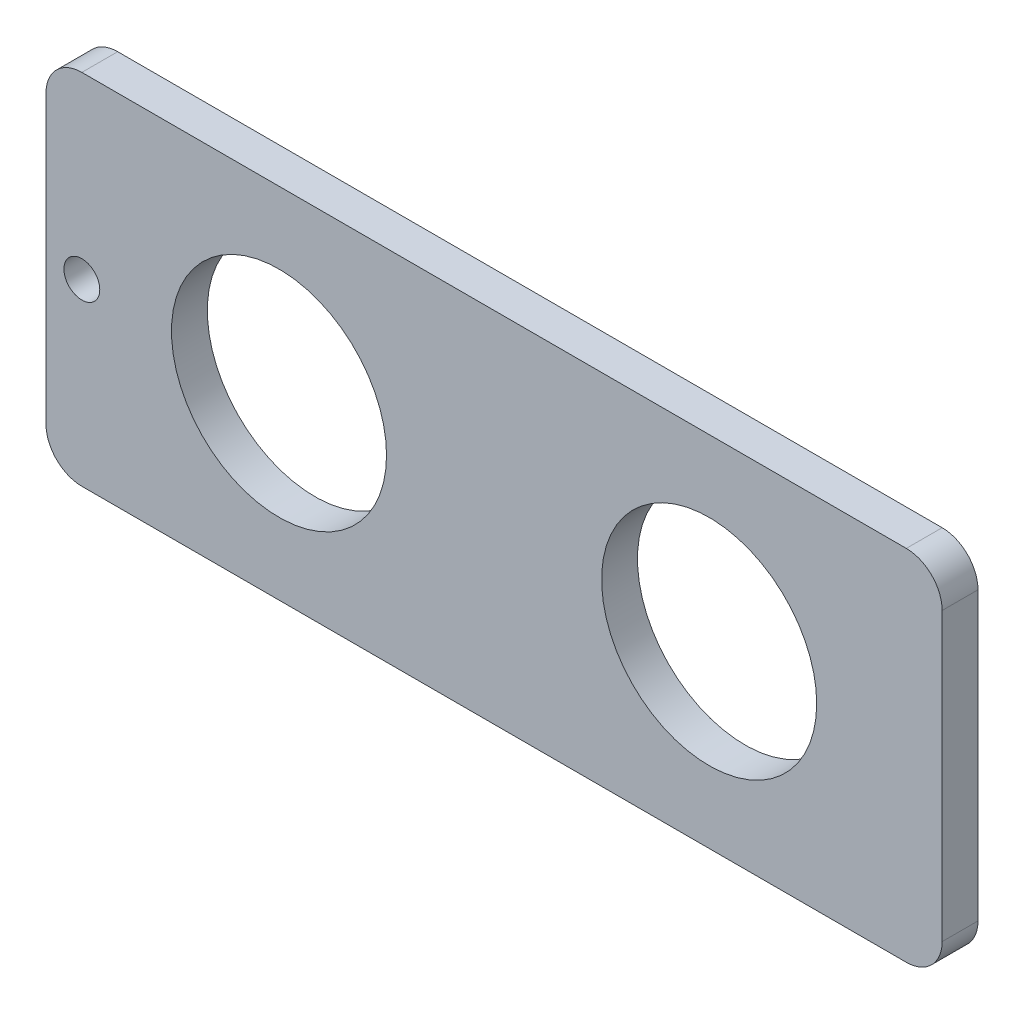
from build123d import *

# Parameters (mm, degrees)
ESQUISSE1_R        = 3
ESQUISSE1_R_2      = 0.5
BOSS_EXTRU_1_DEPTH = 1


with BuildPart() as part:
    # Esquisse1 → Boss.-Extru.1 (new body)
    with BuildSketch(Plane.XY):
        with BuildLine():
            Line((-11.5, -5), (11.5, -5))
            ThreePointArc((11.5, -5), (12.207106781, -4.707106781), (12.5, -4))
            Line((12.5, -4), (12.5, 4))
            ThreePointArc((12.5, 4), (12.207106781, 4.707106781), (11.5, 5))
            Line((11.5, 5), (-11.5, 5))
            ThreePointArc((-11.5, 5), (-12.207106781, 4.707106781), (-12.5, 4))
            Line((-12.5, 4), (-12.5, -4))
            ThreePointArc((-12.5, -4), (-12.207106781, -4.707106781), (-11.5, -5))
        make_face()
        with Locations((-6, 0)):
            Circle(ESQUISSE1_R, mode=Mode.SUBTRACT)
        with Locations((6, 0)):
            Circle(ESQUISSE1_R, mode=Mode.SUBTRACT)
        with Locations((-11.5, 0)):
            Circle(ESQUISSE1_R_2, mode=Mode.SUBTRACT)
    extrude(amount=BOSS_EXTRU_1_DEPTH)


solid = part.part
